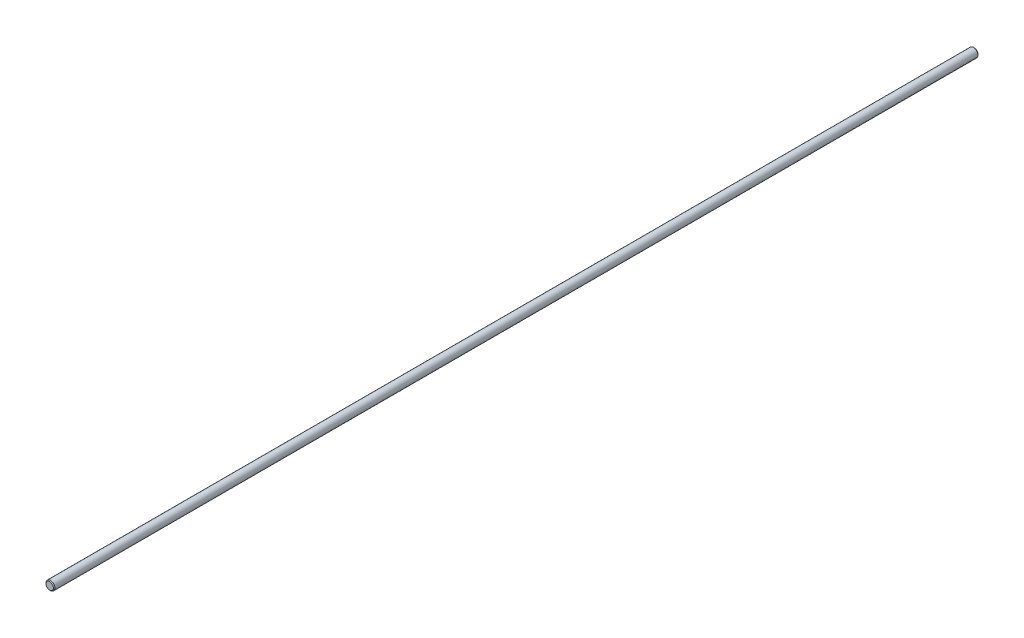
from build123d import *

# Parameters (mm, degrees)
SKETCH1_R      = 4.7625
EXTRUDE1_DEPTH = 990.6
CHAMFER1_SIZE  = 0.79375


with BuildPart() as part:
    # Sketch1 → Extrude1 (new body)
    with BuildSketch(Plane.XY):
        Circle(SKETCH1_R)
    extrude(amount=EXTRUDE1_DEPTH)

    # Chamfer1
    chamfer1_edges = [part.edges().sort_by_distance(p)[0] for p in [
        (-4.7625, 0, 0),
        (-4.7625, 0, 990.6),
    ]]
    chamfer(chamfer1_edges, length=CHAMFER1_SIZE)


solid = part.part
